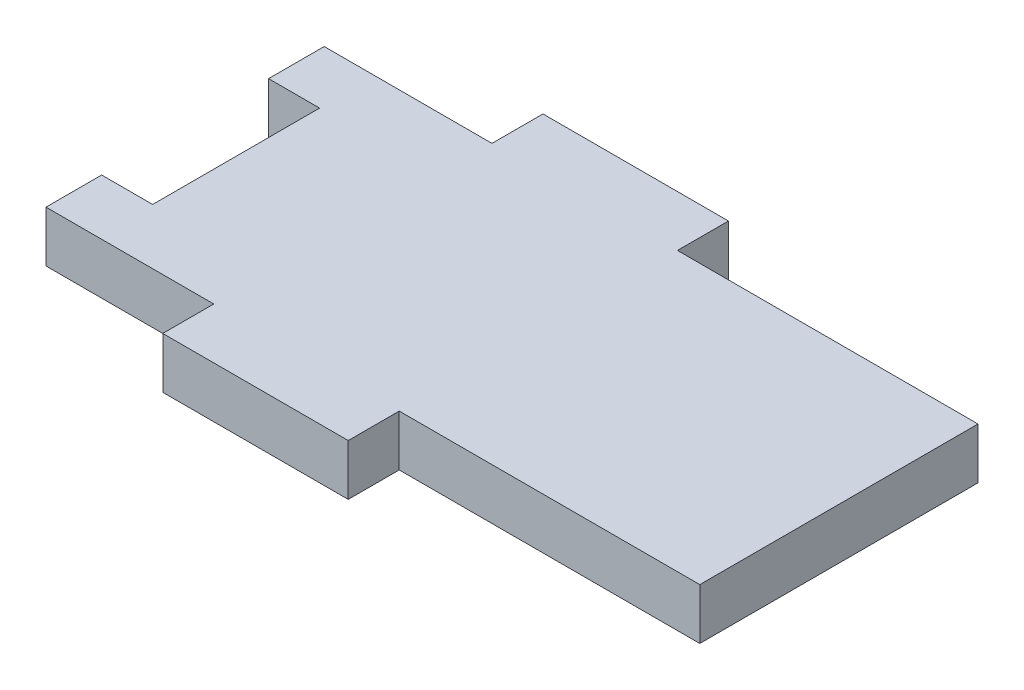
ISO-10303-21;
HEADER;
FILE_DESCRIPTION(('STEP AP214'),'2;1');
FILE_NAME('part.step','',(''),(''),'','','');
FILE_SCHEMA(('AUTOMOTIVE_DESIGN { 1 0 10303 214 1 1 1 1 }'));
ENDSEC;
DATA;
#1=APPLICATION_CONTEXT('core data for automotive mechanical design processes');
#2=APPLICATION_PROTOCOL_DEFINITION('international standard','automotive_design',2000,#1);
#3=PRODUCT_CONTEXT('',#1,'mechanical');
#4=PRODUCT('Part','Part','',(#3));
#5=PRODUCT_RELATED_PRODUCT_CATEGORY('part','',(#4));
#6=PRODUCT_DEFINITION_FORMATION('','',#4);
#7=PRODUCT_DEFINITION_CONTEXT('part definition',#1,'design');
#8=PRODUCT_DEFINITION('design','',#6,#7);
#9=PRODUCT_DEFINITION_SHAPE('','',#8);
#10=(LENGTH_UNIT() NAMED_UNIT(*) SI_UNIT(.MILLI.,.METRE.));
#11=(NAMED_UNIT(*) PLANE_ANGLE_UNIT() SI_UNIT($,.RADIAN.));
#12=(NAMED_UNIT(*) SI_UNIT($,.STERADIAN.) SOLID_ANGLE_UNIT());
#13=UNCERTAINTY_MEASURE_WITH_UNIT(LENGTH_MEASURE(1.E-05),#10,'distance_accuracy_value','');
#14=(GEOMETRIC_REPRESENTATION_CONTEXT(3) GLOBAL_UNCERTAINTY_ASSIGNED_CONTEXT((#13)) GLOBAL_UNIT_ASSIGNED_CONTEXT((#10,
#11,#12)) REPRESENTATION_CONTEXT('',''));
#15=CARTESIAN_POINT('',(0.,0.,0.));
#16=DIRECTION('',(0.,0.,1.));
#17=DIRECTION('',(1.,0.,0.));
#18=AXIS2_PLACEMENT_3D('',#15,#16,#17);
#19=CARTESIAN_POINT('',(11.1323529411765,5.5,-9.04294117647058));
#20=DIRECTION('',(0.,0.,1.));
#21=DIRECTION('',(1.,0.,0.));
#22=AXIS2_PLACEMENT_3D('',#19,#20,#21);
#23=PLANE('',#22);
#24=DIRECTION('',(-1.,0.,0.));
#25=VECTOR('',#24,1.);
#26=CARTESIAN_POINT('',(11.1323529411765,0.,-9.04294117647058));
#27=LINE('',#26,#25);
#28=CARTESIAN_POINT('',(43.5423529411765,0.,-9.04294117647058));
#29=VERTEX_POINT('',#28);
#30=CARTESIAN_POINT('',(11.1323529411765,0.,-9.04294117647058));
#31=VERTEX_POINT('',#30);
#32=EDGE_CURVE('E192',#29,#31,#27,.T.);
#33=ORIENTED_EDGE('',*,*,#32,.T.);
#34=DIRECTION('',(0.,-1.,0.));
#35=VECTOR('',#34,1.);
#36=CARTESIAN_POINT('',(11.1323529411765,5.5,-9.04294117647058));
#37=LINE('',#36,#35);
#38=CARTESIAN_POINT('',(11.1323529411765,5.5,-9.04294117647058));
#39=VERTEX_POINT('',#38);
#40=EDGE_CURVE('E11',#39,#31,#37,.T.);
#41=ORIENTED_EDGE('',*,*,#40,.F.);
#42=DIRECTION('',(-1.,0.,0.));
#43=VECTOR('',#42,1.);
#44=CARTESIAN_POINT('',(11.1323529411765,5.5,-9.04294117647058));
#45=LINE('',#44,#43);
#46=CARTESIAN_POINT('',(43.5423529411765,5.5,-9.04294117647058));
#47=VERTEX_POINT('',#46);
#48=EDGE_CURVE('E238',#47,#39,#45,.T.);
#49=ORIENTED_EDGE('',*,*,#48,.F.);
#50=DIRECTION('',(0.,-1.,0.));
#51=VECTOR('',#50,1.);
#52=CARTESIAN_POINT('',(43.5423529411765,5.5,-9.04294117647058));
#53=LINE('',#52,#51);
#54=EDGE_CURVE('E188',#47,#29,#53,.T.);
#55=ORIENTED_EDGE('',*,*,#54,.T.);
#56=EDGE_LOOP('',(#33,#41,#49,#55));
#57=FACE_BOUND('',#56,.T.);
#58=ADVANCED_FACE('F43',(#57),#23,.F.);
#59=CARTESIAN_POINT('',(11.1323529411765,5.5,-14.5429411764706));
#60=DIRECTION('',(-1.,0.,0.));
#61=DIRECTION('',(0.,0.,1.));
#62=AXIS2_PLACEMENT_3D('',#59,#60,#61);
#63=PLANE('',#62);
#64=DIRECTION('',(0.,0.,-1.));
#65=VECTOR('',#64,1.);
#66=CARTESIAN_POINT('',(11.1323529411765,0.,-14.5429411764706));
#67=LINE('',#66,#65);
#68=CARTESIAN_POINT('',(11.1323529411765,0.,-14.5429411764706));
#69=VERTEX_POINT('',#68);
#70=EDGE_CURVE('E196',#31,#69,#67,.T.);
#71=ORIENTED_EDGE('',*,*,#70,.T.);
#72=DIRECTION('',(0.,-1.,0.));
#73=VECTOR('',#72,1.);
#74=CARTESIAN_POINT('',(11.1323529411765,5.5,-14.5429411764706));
#75=LINE('',#74,#73);
#76=CARTESIAN_POINT('',(11.1323529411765,5.5,-14.5429411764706));
#77=VERTEX_POINT('',#76);
#78=EDGE_CURVE('E52',#77,#69,#75,.T.);
#79=ORIENTED_EDGE('',*,*,#78,.F.);
#80=DIRECTION('',(0.,0.,-1.));
#81=VECTOR('',#80,1.);
#82=CARTESIAN_POINT('',(11.1323529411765,5.5,-14.5429411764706));
#83=LINE('',#82,#81);
#84=EDGE_CURVE('E127',#39,#77,#83,.T.);
#85=ORIENTED_EDGE('',*,*,#84,.F.);
#86=ORIENTED_EDGE('',*,*,#40,.T.);
#87=EDGE_LOOP('',(#71,#79,#85,#86));
#88=FACE_BOUND('',#87,.T.);
#89=ADVANCED_FACE('F360',(#88),#63,.F.);
#90=CARTESIAN_POINT('',(-8.86764705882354,5.5,-14.5429411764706));
#91=DIRECTION('',(0.,0.,1.));
#92=DIRECTION('',(1.,0.,0.));
#93=AXIS2_PLACEMENT_3D('',#90,#91,#92);
#94=PLANE('',#93);
#95=DIRECTION('',(-1.,0.,0.));
#96=VECTOR('',#95,1.);
#97=CARTESIAN_POINT('',(-8.86764705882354,0.,-14.5429411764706));
#98=LINE('',#97,#96);
#99=CARTESIAN_POINT('',(-8.86764705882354,0.,-14.5429411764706));
#100=VERTEX_POINT('',#99);
#101=EDGE_CURVE('E199',#69,#100,#98,.T.);
#102=ORIENTED_EDGE('',*,*,#101,.T.);
#103=DIRECTION('',(0.,-1.,0.));
#104=VECTOR('',#103,1.);
#105=CARTESIAN_POINT('',(-8.86764705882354,5.5,-14.5429411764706));
#106=LINE('',#105,#104);
#107=CARTESIAN_POINT('',(-8.86764705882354,5.5,-14.5429411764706));
#108=VERTEX_POINT('',#107);
#109=EDGE_CURVE('E281',#108,#100,#106,.T.);
#110=ORIENTED_EDGE('',*,*,#109,.F.);
#111=DIRECTION('',(-1.,0.,0.));
#112=VECTOR('',#111,1.);
#113=CARTESIAN_POINT('',(-8.86764705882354,5.5,-14.5429411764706));
#114=LINE('',#113,#112);
#115=EDGE_CURVE('E291',#77,#108,#114,.T.);
#116=ORIENTED_EDGE('',*,*,#115,.F.);
#117=ORIENTED_EDGE('',*,*,#78,.T.);
#118=EDGE_LOOP('',(#102,#110,#116,#117));
#119=FACE_BOUND('',#118,.T.);
#120=ADVANCED_FACE('F289',(#119),#94,.F.);
#121=CARTESIAN_POINT('',(-8.86764705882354,5.5,-14.5429411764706));
#122=DIRECTION('',(1.,0.,0.));
#123=DIRECTION('',(0.,0.,-1.));
#124=AXIS2_PLACEMENT_3D('',#121,#122,#123);
#125=PLANE('',#124);
#126=DIRECTION('',(0.,0.,1.));
#127=VECTOR('',#126,1.);
#128=CARTESIAN_POINT('',(-8.86764705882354,0.,-14.5429411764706));
#129=LINE('',#128,#127);
#130=CARTESIAN_POINT('',(-8.86764705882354,0.,-9.04294117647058));
#131=VERTEX_POINT('',#130);
#132=EDGE_CURVE('E202',#100,#131,#129,.T.);
#133=ORIENTED_EDGE('',*,*,#132,.T.);
#134=DIRECTION('',(0.,-1.,0.));
#135=VECTOR('',#134,1.);
#136=CARTESIAN_POINT('',(-8.86764705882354,5.5,-9.04294117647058));
#137=LINE('',#136,#135);
#138=CARTESIAN_POINT('',(-8.86764705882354,5.5,-9.04294117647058));
#139=VERTEX_POINT('',#138);
#140=EDGE_CURVE('E277',#139,#131,#137,.T.);
#141=ORIENTED_EDGE('',*,*,#140,.F.);
#142=DIRECTION('',(0.,0.,1.));
#143=VECTOR('',#142,1.);
#144=CARTESIAN_POINT('',(-8.86764705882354,5.5,-14.5429411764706));
#145=LINE('',#144,#143);
#146=EDGE_CURVE('E310',#108,#139,#145,.T.);
#147=ORIENTED_EDGE('',*,*,#146,.F.);
#148=ORIENTED_EDGE('',*,*,#109,.T.);
#149=EDGE_LOOP('',(#133,#141,#147,#148));
#150=FACE_BOUND('',#149,.T.);
#151=ADVANCED_FACE('F300',(#150),#125,.F.);
#152=CARTESIAN_POINT('',(-26.9576470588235,5.5,-9.04294117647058));
#153=DIRECTION('',(0.,0.,1.));
#154=DIRECTION('',(1.,0.,0.));
#155=AXIS2_PLACEMENT_3D('',#152,#153,#154);
#156=PLANE('',#155);
#157=DIRECTION('',(-1.,0.,0.));
#158=VECTOR('',#157,1.);
#159=CARTESIAN_POINT('',(-26.9576470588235,0.,-9.04294117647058));
#160=LINE('',#159,#158);
#161=CARTESIAN_POINT('',(-26.9576470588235,0.,-9.04294117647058));
#162=VERTEX_POINT('',#161);
#163=EDGE_CURVE('E205',#131,#162,#160,.T.);
#164=ORIENTED_EDGE('',*,*,#163,.T.);
#165=DIRECTION('',(0.,-1.,0.));
#166=VECTOR('',#165,1.);
#167=CARTESIAN_POINT('',(-26.9576470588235,5.5,-9.04294117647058));
#168=LINE('',#167,#166);
#169=CARTESIAN_POINT('',(-26.9576470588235,5.5,-9.04294117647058));
#170=VERTEX_POINT('',#169);
#171=EDGE_CURVE('E273',#170,#162,#168,.T.);
#172=ORIENTED_EDGE('',*,*,#171,.F.);
#173=DIRECTION('',(-1.,0.,0.));
#174=VECTOR('',#173,1.);
#175=CARTESIAN_POINT('',(-26.9576470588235,5.5,-9.04294117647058));
#176=LINE('',#175,#174);
#177=EDGE_CURVE('E306',#139,#170,#176,.T.);
#178=ORIENTED_EDGE('',*,*,#177,.F.);
#179=ORIENTED_EDGE('',*,*,#140,.T.);
#180=EDGE_LOOP('',(#164,#172,#178,#179));
#181=FACE_BOUND('',#180,.T.);
#182=ADVANCED_FACE('F304',(#181),#156,.F.);
#183=CARTESIAN_POINT('',(-26.9576470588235,5.5,-9.04294117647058));
#184=DIRECTION('',(1.,0.,0.));
#185=DIRECTION('',(0.,0.,-1.));
#186=AXIS2_PLACEMENT_3D('',#183,#184,#185);
#187=PLANE('',#186);
#188=DIRECTION('',(0.,0.,1.));
#189=VECTOR('',#188,1.);
#190=CARTESIAN_POINT('',(-26.9576470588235,0.,-9.04294117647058));
#191=LINE('',#190,#189);
#192=CARTESIAN_POINT('',(-26.9576470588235,0.,-3.04294117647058));
#193=VERTEX_POINT('',#192);
#194=EDGE_CURVE('E208',#162,#193,#191,.T.);
#195=ORIENTED_EDGE('',*,*,#194,.T.);
#196=DIRECTION('',(0.,-1.,0.));
#197=VECTOR('',#196,1.);
#198=CARTESIAN_POINT('',(-26.9576470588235,5.5,-3.04294117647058));
#199=LINE('',#198,#197);
#200=CARTESIAN_POINT('',(-26.9576470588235,5.5,-3.04294117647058));
#201=VERTEX_POINT('',#200);
#202=EDGE_CURVE('E269',#201,#193,#199,.T.);
#203=ORIENTED_EDGE('',*,*,#202,.F.);
#204=DIRECTION('',(0.,0.,1.));
#205=VECTOR('',#204,1.);
#206=CARTESIAN_POINT('',(-26.9576470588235,5.5,-9.04294117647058));
#207=LINE('',#206,#205);
#208=EDGE_CURVE('E309',#170,#201,#207,.T.);
#209=ORIENTED_EDGE('',*,*,#208,.F.);
#210=ORIENTED_EDGE('',*,*,#171,.T.);
#211=EDGE_LOOP('',(#195,#203,#209,#210));
#212=FACE_BOUND('',#211,.T.);
#213=ADVANCED_FACE('F373',(#212),#187,.F.);
#214=CARTESIAN_POINT('',(-26.9576470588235,5.5,-3.04294117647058));
#215=DIRECTION('',(0.,0.,-1.));
#216=DIRECTION('',(-1.,0.,0.));
#217=AXIS2_PLACEMENT_3D('',#214,#215,#216);
#218=PLANE('',#217);
#219=DIRECTION('',(1.,0.,0.));
#220=VECTOR('',#219,1.);
#221=CARTESIAN_POINT('',(-26.9576470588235,0.,-3.04294117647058));
#222=LINE('',#221,#220);
#223=CARTESIAN_POINT('',(-21.4576470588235,0.,-3.04294117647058));
#224=VERTEX_POINT('',#223);
#225=EDGE_CURVE('E211',#193,#224,#222,.T.);
#226=ORIENTED_EDGE('',*,*,#225,.T.);
#227=DIRECTION('',(0.,-1.,0.));
#228=VECTOR('',#227,1.);
#229=CARTESIAN_POINT('',(-21.4576470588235,5.5,-3.04294117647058));
#230=LINE('',#229,#228);
#231=CARTESIAN_POINT('',(-21.4576470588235,5.5,-3.04294117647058));
#232=VERTEX_POINT('',#231);
#233=EDGE_CURVE('E265',#232,#224,#230,.T.);
#234=ORIENTED_EDGE('',*,*,#233,.F.);
#235=DIRECTION('',(1.,0.,0.));
#236=VECTOR('',#235,1.);
#237=CARTESIAN_POINT('',(-26.9576470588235,5.5,-3.04294117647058));
#238=LINE('',#237,#236);
#239=EDGE_CURVE('E314',#201,#232,#238,.T.);
#240=ORIENTED_EDGE('',*,*,#239,.F.);
#241=ORIENTED_EDGE('',*,*,#202,.T.);
#242=EDGE_LOOP('',(#226,#234,#240,#241));
#243=FACE_BOUND('',#242,.T.);
#244=ADVANCED_FACE('F376',(#243),#218,.F.);
#245=CARTESIAN_POINT('',(-21.4576470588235,5.5,-3.04294117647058));
#246=DIRECTION('',(1.,0.,0.));
#247=DIRECTION('',(0.,0.,-1.));
#248=AXIS2_PLACEMENT_3D('',#245,#246,#247);
#249=PLANE('',#248);
#250=DIRECTION('',(0.,0.,1.));
#251=VECTOR('',#250,1.);
#252=CARTESIAN_POINT('',(-21.4576470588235,0.,-3.04294117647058));
#253=LINE('',#252,#251);
#254=CARTESIAN_POINT('',(-21.4576470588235,0.,14.9570588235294));
#255=VERTEX_POINT('',#254);
#256=EDGE_CURVE('E214',#224,#255,#253,.T.);
#257=ORIENTED_EDGE('',*,*,#256,.T.);
#258=DIRECTION('',(0.,-1.,0.));
#259=VECTOR('',#258,1.);
#260=CARTESIAN_POINT('',(-21.4576470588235,5.5,14.9570588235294));
#261=LINE('',#260,#259);
#262=CARTESIAN_POINT('',(-21.4576470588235,5.5,14.9570588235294));
#263=VERTEX_POINT('',#262);
#264=EDGE_CURVE('E261',#263,#255,#261,.T.);
#265=ORIENTED_EDGE('',*,*,#264,.F.);
#266=DIRECTION('',(0.,0.,1.));
#267=VECTOR('',#266,1.);
#268=CARTESIAN_POINT('',(-21.4576470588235,5.5,-3.04294117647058));
#269=LINE('',#268,#267);
#270=EDGE_CURVE('E321',#232,#263,#269,.T.);
#271=ORIENTED_EDGE('',*,*,#270,.F.);
#272=ORIENTED_EDGE('',*,*,#233,.T.);
#273=EDGE_LOOP('',(#257,#265,#271,#272));
#274=FACE_BOUND('',#273,.T.);
#275=ADVANCED_FACE('F380',(#274),#249,.F.);
#276=CARTESIAN_POINT('',(-26.9576470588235,5.5,14.9570588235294));
#277=DIRECTION('',(0.,0.,1.));
#278=DIRECTION('',(1.,0.,0.));
#279=AXIS2_PLACEMENT_3D('',#276,#277,#278);
#280=PLANE('',#279);
#281=DIRECTION('',(-1.,0.,0.));
#282=VECTOR('',#281,1.);
#283=CARTESIAN_POINT('',(-26.9576470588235,0.,14.9570588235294));
#284=LINE('',#283,#282);
#285=CARTESIAN_POINT('',(-26.9576470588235,0.,14.9570588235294));
#286=VERTEX_POINT('',#285);
#287=EDGE_CURVE('E217',#255,#286,#284,.T.);
#288=ORIENTED_EDGE('',*,*,#287,.T.);
#289=DIRECTION('',(0.,-1.,0.));
#290=VECTOR('',#289,1.);
#291=CARTESIAN_POINT('',(-26.9576470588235,5.5,14.9570588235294));
#292=LINE('',#291,#290);
#293=CARTESIAN_POINT('',(-26.9576470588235,5.5,14.9570588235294));
#294=VERTEX_POINT('',#293);
#295=EDGE_CURVE('E257',#294,#286,#292,.T.);
#296=ORIENTED_EDGE('',*,*,#295,.F.);
#297=DIRECTION('',(-1.,0.,0.));
#298=VECTOR('',#297,1.);
#299=CARTESIAN_POINT('',(-26.9576470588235,5.5,14.9570588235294));
#300=LINE('',#299,#298);
#301=EDGE_CURVE('E324',#263,#294,#300,.T.);
#302=ORIENTED_EDGE('',*,*,#301,.F.);
#303=ORIENTED_EDGE('',*,*,#264,.T.);
#304=EDGE_LOOP('',(#288,#296,#302,#303));
#305=FACE_BOUND('',#304,.T.);
#306=ADVANCED_FACE('F384',(#305),#280,.F.);
#307=CARTESIAN_POINT('',(-26.9576470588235,5.5,20.9570588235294));
#308=DIRECTION('',(1.,0.,0.));
#309=DIRECTION('',(0.,0.,-1.));
#310=AXIS2_PLACEMENT_3D('',#307,#308,#309);
#311=PLANE('',#310);
#312=DIRECTION('',(0.,0.,1.));
#313=VECTOR('',#312,1.);
#314=CARTESIAN_POINT('',(-26.9576470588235,0.,20.9570588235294));
#315=LINE('',#314,#313);
#316=CARTESIAN_POINT('',(-26.9576470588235,0.,20.9570588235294));
#317=VERTEX_POINT('',#316);
#318=EDGE_CURVE('E220',#286,#317,#315,.T.);
#319=ORIENTED_EDGE('',*,*,#318,.T.);
#320=DIRECTION('',(0.,-1.,0.));
#321=VECTOR('',#320,1.);
#322=CARTESIAN_POINT('',(-26.9576470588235,5.5,20.9570588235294));
#323=LINE('',#322,#321);
#324=CARTESIAN_POINT('',(-26.9576470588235,5.5,20.9570588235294));
#325=VERTEX_POINT('',#324);
#326=EDGE_CURVE('E253',#325,#317,#323,.T.);
#327=ORIENTED_EDGE('',*,*,#326,.F.);
#328=DIRECTION('',(0.,0.,1.));
#329=VECTOR('',#328,1.);
#330=CARTESIAN_POINT('',(-26.9576470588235,5.5,20.9570588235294));
#331=LINE('',#330,#329);
#332=EDGE_CURVE('E327',#294,#325,#331,.T.);
#333=ORIENTED_EDGE('',*,*,#332,.F.);
#334=ORIENTED_EDGE('',*,*,#295,.T.);
#335=EDGE_LOOP('',(#319,#327,#333,#334));
#336=FACE_BOUND('',#335,.T.);
#337=ADVANCED_FACE('F388',(#336),#311,.F.);
#338=CARTESIAN_POINT('',(-26.9576470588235,5.5,20.9570588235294));
#339=DIRECTION('',(0.,0.,-1.));
#340=DIRECTION('',(-1.,0.,0.));
#341=AXIS2_PLACEMENT_3D('',#338,#339,#340);
#342=PLANE('',#341);
#343=DIRECTION('',(1.,0.,0.));
#344=VECTOR('',#343,1.);
#345=CARTESIAN_POINT('',(-26.9576470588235,0.,20.9570588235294));
#346=LINE('',#345,#344);
#347=CARTESIAN_POINT('',(-8.86764705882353,0.,20.9570588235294));
#348=VERTEX_POINT('',#347);
#349=EDGE_CURVE('E223',#317,#348,#346,.T.);
#350=ORIENTED_EDGE('',*,*,#349,.T.);
#351=DIRECTION('',(0.,-1.,0.));
#352=VECTOR('',#351,1.);
#353=CARTESIAN_POINT('',(-8.86764705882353,5.5,20.9570588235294));
#354=LINE('',#353,#352);
#355=CARTESIAN_POINT('',(-8.86764705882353,5.5,20.9570588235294));
#356=VERTEX_POINT('',#355);
#357=EDGE_CURVE('E249',#356,#348,#354,.T.);
#358=ORIENTED_EDGE('',*,*,#357,.F.);
#359=DIRECTION('',(1.,0.,0.));
#360=VECTOR('',#359,1.);
#361=CARTESIAN_POINT('',(-26.9576470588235,5.5,20.9570588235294));
#362=LINE('',#361,#360);
#363=EDGE_CURVE('E330',#325,#356,#362,.T.);
#364=ORIENTED_EDGE('',*,*,#363,.F.);
#365=ORIENTED_EDGE('',*,*,#326,.T.);
#366=EDGE_LOOP('',(#350,#358,#364,#365));
#367=FACE_BOUND('',#366,.T.);
#368=ADVANCED_FACE('F392',(#367),#342,.F.);
#369=CARTESIAN_POINT('',(-8.86764705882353,5.5,20.9570588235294));
#370=DIRECTION('',(1.,0.,0.));
#371=DIRECTION('',(0.,0.,-1.));
#372=AXIS2_PLACEMENT_3D('',#369,#370,#371);
#373=PLANE('',#372);
#374=DIRECTION('',(0.,0.,1.));
#375=VECTOR('',#374,1.);
#376=CARTESIAN_POINT('',(-8.86764705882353,0.,20.9570588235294));
#377=LINE('',#376,#375);
#378=CARTESIAN_POINT('',(-8.86764705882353,0.,26.4570588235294));
#379=VERTEX_POINT('',#378);
#380=EDGE_CURVE('E226',#348,#379,#377,.T.);
#381=ORIENTED_EDGE('',*,*,#380,.T.);
#382=DIRECTION('',(0.,-1.,0.));
#383=VECTOR('',#382,1.);
#384=CARTESIAN_POINT('',(-8.86764705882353,5.5,26.4570588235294));
#385=LINE('',#384,#383);
#386=CARTESIAN_POINT('',(-8.86764705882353,5.5,26.4570588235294));
#387=VERTEX_POINT('',#386);
#388=EDGE_CURVE('E245',#387,#379,#385,.T.);
#389=ORIENTED_EDGE('',*,*,#388,.F.);
#390=DIRECTION('',(0.,0.,1.));
#391=VECTOR('',#390,1.);
#392=CARTESIAN_POINT('',(-8.86764705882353,5.5,20.9570588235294));
#393=LINE('',#392,#391);
#394=EDGE_CURVE('E333',#356,#387,#393,.T.);
#395=ORIENTED_EDGE('',*,*,#394,.F.);
#396=ORIENTED_EDGE('',*,*,#357,.T.);
#397=EDGE_LOOP('',(#381,#389,#395,#396));
#398=FACE_BOUND('',#397,.T.);
#399=ADVANCED_FACE('F341',(#398),#373,.F.);
#400=CARTESIAN_POINT('',(-8.86764705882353,5.5,26.4570588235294));
#401=DIRECTION('',(0.,0.,-1.));
#402=DIRECTION('',(-1.,0.,0.));
#403=AXIS2_PLACEMENT_3D('',#400,#401,#402);
#404=PLANE('',#403);
#405=DIRECTION('',(1.,0.,0.));
#406=VECTOR('',#405,1.);
#407=CARTESIAN_POINT('',(-8.86764705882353,0.,26.4570588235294));
#408=LINE('',#407,#406);
#409=CARTESIAN_POINT('',(11.1323529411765,0.,26.4570588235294));
#410=VERTEX_POINT('',#409);
#411=EDGE_CURVE('E229',#379,#410,#408,.T.);
#412=ORIENTED_EDGE('',*,*,#411,.T.);
#413=DIRECTION('',(0.,-1.,0.));
#414=VECTOR('',#413,1.);
#415=CARTESIAN_POINT('',(11.1323529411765,5.5,26.4570588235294));
#416=LINE('',#415,#414);
#417=CARTESIAN_POINT('',(11.1323529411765,5.5,26.4570588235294));
#418=VERTEX_POINT('',#417);
#419=EDGE_CURVE('E181',#418,#410,#416,.T.);
#420=ORIENTED_EDGE('',*,*,#419,.F.);
#421=DIRECTION('',(1.,0.,0.));
#422=VECTOR('',#421,1.);
#423=CARTESIAN_POINT('',(-8.86764705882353,5.5,26.4570588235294));
#424=LINE('',#423,#422);
#425=EDGE_CURVE('E170',#387,#418,#424,.T.);
#426=ORIENTED_EDGE('',*,*,#425,.F.);
#427=ORIENTED_EDGE('',*,*,#388,.T.);
#428=EDGE_LOOP('',(#412,#420,#426,#427));
#429=FACE_BOUND('',#428,.T.);
#430=ADVANCED_FACE('F345',(#429),#404,.F.);
#431=CARTESIAN_POINT('',(11.1323529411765,5.5,26.4570588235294));
#432=DIRECTION('',(-1.,0.,0.));
#433=DIRECTION('',(0.,0.,1.));
#434=AXIS2_PLACEMENT_3D('',#431,#432,#433);
#435=PLANE('',#434);
#436=DIRECTION('',(0.,0.,-1.));
#437=VECTOR('',#436,1.);
#438=CARTESIAN_POINT('',(11.1323529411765,0.,26.4570588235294));
#439=LINE('',#438,#437);
#440=CARTESIAN_POINT('',(11.1323529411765,0.,20.9570588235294));
#441=VERTEX_POINT('',#440);
#442=EDGE_CURVE('E179',#410,#441,#439,.T.);
#443=ORIENTED_EDGE('',*,*,#442,.T.);
#444=DIRECTION('',(0.,-1.,0.));
#445=VECTOR('',#444,1.);
#446=CARTESIAN_POINT('',(11.1323529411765,5.5,20.9570588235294));
#447=LINE('',#446,#445);
#448=CARTESIAN_POINT('',(11.1323529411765,5.5,20.9570588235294));
#449=VERTEX_POINT('',#448);
#450=EDGE_CURVE('E176',#449,#441,#447,.T.);
#451=ORIENTED_EDGE('',*,*,#450,.F.);
#452=DIRECTION('',(0.,0.,-1.));
#453=VECTOR('',#452,1.);
#454=CARTESIAN_POINT('',(11.1323529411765,5.5,26.4570588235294));
#455=LINE('',#454,#453);
#456=EDGE_CURVE('E164',#418,#449,#455,.T.);
#457=ORIENTED_EDGE('',*,*,#456,.F.);
#458=ORIENTED_EDGE('',*,*,#419,.T.);
#459=EDGE_LOOP('',(#443,#451,#457,#458));
#460=FACE_BOUND('',#459,.T.);
#461=ADVANCED_FACE('F177',(#460),#435,.F.);
#462=CARTESIAN_POINT('',(11.1323529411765,5.5,20.9570588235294));
#463=DIRECTION('',(0.,0.,-1.));
#464=DIRECTION('',(-1.,0.,0.));
#465=AXIS2_PLACEMENT_3D('',#462,#463,#464);
#466=PLANE('',#465);
#467=DIRECTION('',(1.,0.,0.));
#468=VECTOR('',#467,1.);
#469=CARTESIAN_POINT('',(11.1323529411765,0.,20.9570588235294));
#470=LINE('',#469,#468);
#471=CARTESIAN_POINT('',(43.5423529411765,0.,20.9570588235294));
#472=VERTEX_POINT('',#471);
#473=EDGE_CURVE('E113',#441,#472,#470,.T.);
#474=ORIENTED_EDGE('',*,*,#473,.T.);
#475=DIRECTION('',(0.,-1.,0.));
#476=VECTOR('',#475,1.);
#477=CARTESIAN_POINT('',(43.5423529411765,5.5,20.9570588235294));
#478=LINE('',#477,#476);
#479=CARTESIAN_POINT('',(43.5423529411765,5.5,20.9570588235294));
#480=VERTEX_POINT('',#479);
#481=EDGE_CURVE('E182',#480,#472,#478,.T.);
#482=ORIENTED_EDGE('',*,*,#481,.F.);
#483=DIRECTION('',(1.,0.,0.));
#484=VECTOR('',#483,1.);
#485=CARTESIAN_POINT('',(11.1323529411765,5.5,20.9570588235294));
#486=LINE('',#485,#484);
#487=EDGE_CURVE('E168',#449,#480,#486,.T.);
#488=ORIENTED_EDGE('',*,*,#487,.F.);
#489=ORIENTED_EDGE('',*,*,#450,.T.);
#490=EDGE_LOOP('',(#474,#482,#488,#489));
#491=FACE_BOUND('',#490,.T.);
#492=ADVANCED_FACE('F184',(#491),#466,.F.);
#493=CARTESIAN_POINT('',(43.5423529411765,5.5,-9.04294117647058));
#494=DIRECTION('',(-1.,0.,0.));
#495=DIRECTION('',(0.,0.,1.));
#496=AXIS2_PLACEMENT_3D('',#493,#494,#495);
#497=PLANE('',#496);
#498=DIRECTION('',(0.,0.,-1.));
#499=VECTOR('',#498,1.);
#500=CARTESIAN_POINT('',(43.5423529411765,0.,-9.04294117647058));
#501=LINE('',#500,#499);
#502=EDGE_CURVE('E119',#472,#29,#501,.T.);
#503=ORIENTED_EDGE('',*,*,#502,.T.);
#504=ORIENTED_EDGE('',*,*,#54,.F.);
#505=DIRECTION('',(0.,0.,-1.));
#506=VECTOR('',#505,1.);
#507=CARTESIAN_POINT('',(43.5423529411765,5.5,-9.04294117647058));
#508=LINE('',#507,#506);
#509=EDGE_CURVE('E60',#480,#47,#508,.T.);
#510=ORIENTED_EDGE('',*,*,#509,.F.);
#511=ORIENTED_EDGE('',*,*,#481,.T.);
#512=EDGE_LOOP('',(#503,#504,#510,#511));
#513=FACE_BOUND('',#512,.T.);
#514=ADVANCED_FACE('F349',(#513),#497,.F.);
#515=CARTESIAN_POINT('',(0.,5.5,0.));
#516=DIRECTION('',(0.,-1.,0.));
#517=DIRECTION('',(0.,0.,-1.));
#518=AXIS2_PLACEMENT_3D('',#515,#516,#517);
#519=PLANE('',#518);
#520=ORIENTED_EDGE('',*,*,#48,.T.);
#521=ORIENTED_EDGE('',*,*,#84,.T.);
#522=ORIENTED_EDGE('',*,*,#115,.T.);
#523=ORIENTED_EDGE('',*,*,#146,.T.);
#524=ORIENTED_EDGE('',*,*,#177,.T.);
#525=ORIENTED_EDGE('',*,*,#208,.T.);
#526=ORIENTED_EDGE('',*,*,#239,.T.);
#527=ORIENTED_EDGE('',*,*,#270,.T.);
#528=ORIENTED_EDGE('',*,*,#301,.T.);
#529=ORIENTED_EDGE('',*,*,#332,.T.);
#530=ORIENTED_EDGE('',*,*,#363,.T.);
#531=ORIENTED_EDGE('',*,*,#394,.T.);
#532=ORIENTED_EDGE('',*,*,#425,.T.);
#533=ORIENTED_EDGE('',*,*,#456,.T.);
#534=ORIENTED_EDGE('',*,*,#487,.T.);
#535=ORIENTED_EDGE('',*,*,#509,.T.);
#536=EDGE_LOOP('',(#520,#521,#522,#523,#524,#525,#526,#527,#528,#529,#530,#531,#532,#533,#534,#535));
#537=FACE_BOUND('',#536,.T.);
#538=ADVANCED_FACE('F166',(#537),#519,.F.);
#539=CARTESIAN_POINT('',(0.,0.,0.));
#540=DIRECTION('',(0.,-1.,0.));
#541=DIRECTION('',(0.,0.,-1.));
#542=AXIS2_PLACEMENT_3D('',#539,#540,#541);
#543=PLANE('',#542);
#544=ORIENTED_EDGE('',*,*,#32,.F.);
#545=ORIENTED_EDGE('',*,*,#502,.F.);
#546=ORIENTED_EDGE('',*,*,#473,.F.);
#547=ORIENTED_EDGE('',*,*,#442,.F.);
#548=ORIENTED_EDGE('',*,*,#411,.F.);
#549=ORIENTED_EDGE('',*,*,#380,.F.);
#550=ORIENTED_EDGE('',*,*,#349,.F.);
#551=ORIENTED_EDGE('',*,*,#318,.F.);
#552=ORIENTED_EDGE('',*,*,#287,.F.);
#553=ORIENTED_EDGE('',*,*,#256,.F.);
#554=ORIENTED_EDGE('',*,*,#225,.F.);
#555=ORIENTED_EDGE('',*,*,#194,.F.);
#556=ORIENTED_EDGE('',*,*,#163,.F.);
#557=ORIENTED_EDGE('',*,*,#132,.F.);
#558=ORIENTED_EDGE('',*,*,#101,.F.);
#559=ORIENTED_EDGE('',*,*,#70,.F.);
#560=EDGE_LOOP('',(#544,#545,#546,#547,#548,#549,#550,#551,#552,#553,#554,#555,#556,#557,#558,#559));
#561=FACE_BOUND('',#560,.T.);
#562=ADVANCED_FACE('F295',(#561),#543,.T.);
#563=CLOSED_SHELL('',(#58,#89,#120,#151,#182,#213,#244,#275,#306,#337,#368,#399,#430,#461,#492,
#514,#538,#562));
#564=MANIFOLD_SOLID_BREP('B2',#563);
#565=ADVANCED_BREP_SHAPE_REPRESENTATION('',(#18,#564),#14);
#566=SHAPE_DEFINITION_REPRESENTATION(#9,#565);
ENDSEC;
END-ISO-10303-21;
